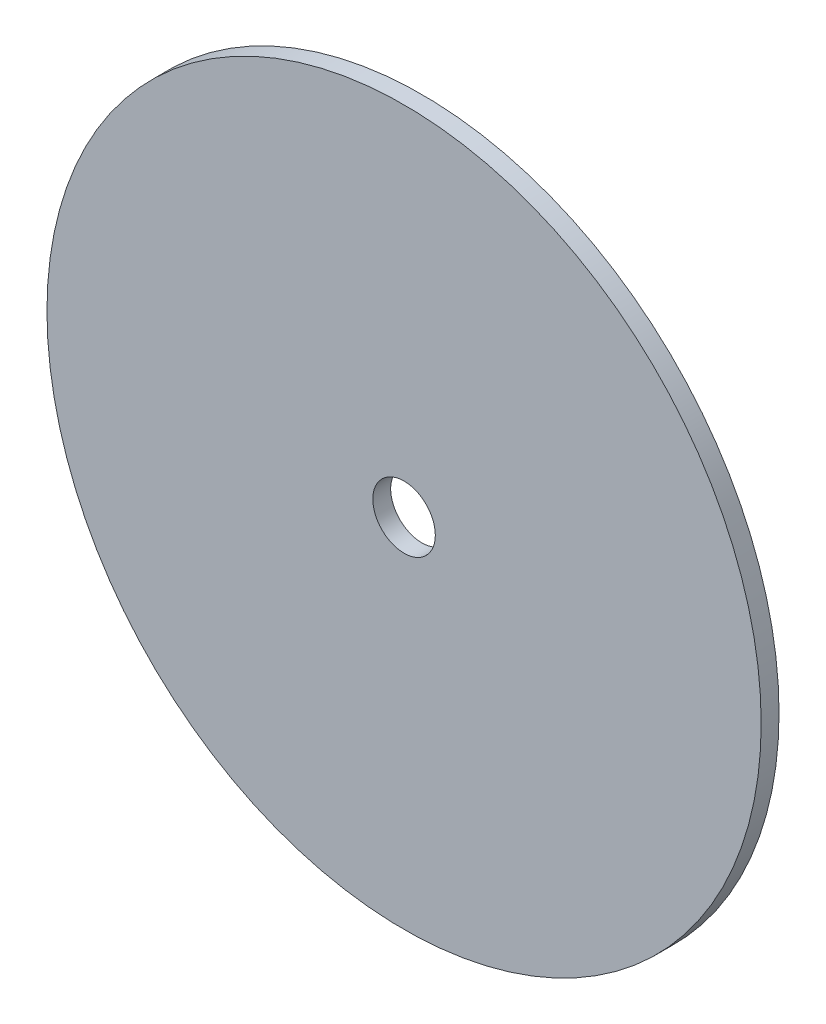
ISO-10303-21;
HEADER;
FILE_DESCRIPTION(('STEP AP214'),'2;1');
FILE_NAME('part.step','',(''),(''),'','','');
FILE_SCHEMA(('AUTOMOTIVE_DESIGN { 1 0 10303 214 1 1 1 1 }'));
ENDSEC;
DATA;
#1=APPLICATION_CONTEXT('core data for automotive mechanical design processes');
#2=APPLICATION_PROTOCOL_DEFINITION('international standard','automotive_design',2000,#1);
#3=PRODUCT_CONTEXT('',#1,'mechanical');
#4=PRODUCT('Part','Part','',(#3));
#5=PRODUCT_RELATED_PRODUCT_CATEGORY('part','',(#4));
#6=PRODUCT_DEFINITION_FORMATION('','',#4);
#7=PRODUCT_DEFINITION_CONTEXT('part definition',#1,'design');
#8=PRODUCT_DEFINITION('design','',#6,#7);
#9=PRODUCT_DEFINITION_SHAPE('','',#8);
#10=(LENGTH_UNIT() NAMED_UNIT(*) SI_UNIT(.MILLI.,.METRE.));
#11=(NAMED_UNIT(*) PLANE_ANGLE_UNIT() SI_UNIT($,.RADIAN.));
#12=(NAMED_UNIT(*) SI_UNIT($,.STERADIAN.) SOLID_ANGLE_UNIT());
#13=UNCERTAINTY_MEASURE_WITH_UNIT(LENGTH_MEASURE(1.E-05),#10,'distance_accuracy_value','');
#14=(GEOMETRIC_REPRESENTATION_CONTEXT(3) GLOBAL_UNCERTAINTY_ASSIGNED_CONTEXT((#13)) GLOBAL_UNIT_ASSIGNED_CONTEXT((#10,
#11,#12)) REPRESENTATION_CONTEXT('',''));
#15=CARTESIAN_POINT('',(0.,0.,0.));
#16=DIRECTION('',(0.,0.,1.));
#17=DIRECTION('',(1.,0.,0.));
#18=AXIS2_PLACEMENT_3D('',#15,#16,#17);
#19=CARTESIAN_POINT('',(0.,0.,1.));
#20=DIRECTION('',(0.,0.,1.));
#21=DIRECTION('',(1.,0.,0.));
#22=AXIS2_PLACEMENT_3D('',#19,#20,#21);
#23=PLANE('',#22);
#24=CARTESIAN_POINT('',(0.,0.,1.));
#25=DIRECTION('',(0.,0.,1.));
#26=DIRECTION('',(1.,0.,0.));
#27=AXIS2_PLACEMENT_3D('',#24,#25,#26);
#28=CIRCLE('',#27,20.);
#29=CARTESIAN_POINT('',(20.,0.,1.));
#30=VERTEX_POINT('',#29);
#31=EDGE_CURVE('E10',#30,#30,#28,.T.);
#32=ORIENTED_EDGE('',*,*,#31,.T.);
#33=EDGE_LOOP('',(#32));
#34=FACE_BOUND('',#33,.T.);
#35=CARTESIAN_POINT('',(0.,0.,1.));
#36=DIRECTION('',(0.,0.,1.));
#37=DIRECTION('',(1.,0.,0.));
#38=AXIS2_PLACEMENT_3D('',#35,#36,#37);
#39=CIRCLE('',#38,1.75);
#40=CARTESIAN_POINT('',(1.75,0.,1.));
#41=VERTEX_POINT('',#40);
#42=EDGE_CURVE('E42',#41,#41,#39,.T.);
#43=ORIENTED_EDGE('',*,*,#42,.F.);
#44=EDGE_LOOP('',(#43));
#45=FACE_BOUND('',#44,.T.);
#46=ADVANCED_FACE('F31',(#34,#45),#23,.T.);
#47=CARTESIAN_POINT('',(0.,0.,0.));
#48=DIRECTION('',(0.,0.,1.));
#49=DIRECTION('',(1.,0.,0.));
#50=AXIS2_PLACEMENT_3D('',#47,#48,#49);
#51=PLANE('',#50);
#52=CARTESIAN_POINT('',(0.,0.,0.));
#53=DIRECTION('',(0.,0.,1.));
#54=DIRECTION('',(1.,0.,0.));
#55=AXIS2_PLACEMENT_3D('',#52,#53,#54);
#56=CIRCLE('',#55,20.);
#57=CARTESIAN_POINT('',(20.,0.,0.));
#58=VERTEX_POINT('',#57);
#59=EDGE_CURVE('E35',#58,#58,#56,.T.);
#60=ORIENTED_EDGE('',*,*,#59,.F.);
#61=EDGE_LOOP('',(#60));
#62=FACE_BOUND('',#61,.T.);
#63=CARTESIAN_POINT('',(0.,0.,0.));
#64=DIRECTION('',(0.,0.,1.));
#65=DIRECTION('',(1.,0.,0.));
#66=AXIS2_PLACEMENT_3D('',#63,#64,#65);
#67=CIRCLE('',#66,1.75);
#68=CARTESIAN_POINT('',(1.75,0.,0.));
#69=VERTEX_POINT('',#68);
#70=EDGE_CURVE('E44',#69,#69,#67,.T.);
#71=ORIENTED_EDGE('',*,*,#70,.T.);
#72=EDGE_LOOP('',(#71));
#73=FACE_BOUND('',#72,.T.);
#74=ADVANCED_FACE('F54',(#62,#73),#51,.F.);
#75=CARTESIAN_POINT('',(0.,0.,1.));
#76=DIRECTION('',(0.,0.,-1.));
#77=DIRECTION('',(-1.,0.,0.));
#78=AXIS2_PLACEMENT_3D('',#75,#76,#77);
#79=CYLINDRICAL_SURFACE('',#78,20.);
#80=ORIENTED_EDGE('',*,*,#31,.F.);
#81=EDGE_LOOP('',(#80));
#82=FACE_BOUND('',#81,.T.);
#83=ORIENTED_EDGE('',*,*,#59,.T.);
#84=EDGE_LOOP('',(#83));
#85=FACE_BOUND('',#84,.T.);
#86=ADVANCED_FACE('F33',(#82,#85),#79,.T.);
#87=CARTESIAN_POINT('',(0.,0.,1.));
#88=DIRECTION('',(0.,0.,-1.));
#89=DIRECTION('',(-1.,0.,0.));
#90=AXIS2_PLACEMENT_3D('',#87,#88,#89);
#91=CYLINDRICAL_SURFACE('',#90,1.75);
#92=ORIENTED_EDGE('',*,*,#42,.T.);
#93=EDGE_LOOP('',(#92));
#94=FACE_BOUND('',#93,.T.);
#95=ORIENTED_EDGE('',*,*,#70,.F.);
#96=EDGE_LOOP('',(#95));
#97=FACE_BOUND('',#96,.T.);
#98=ADVANCED_FACE('F50',(#94,#97),#91,.F.);
#99=CLOSED_SHELL('',(#46,#74,#86,#98));
#100=MANIFOLD_SOLID_BREP('B2',#99);
#101=ADVANCED_BREP_SHAPE_REPRESENTATION('',(#18,#100),#14);
#102=SHAPE_DEFINITION_REPRESENTATION(#9,#101);
ENDSEC;
END-ISO-10303-21;
